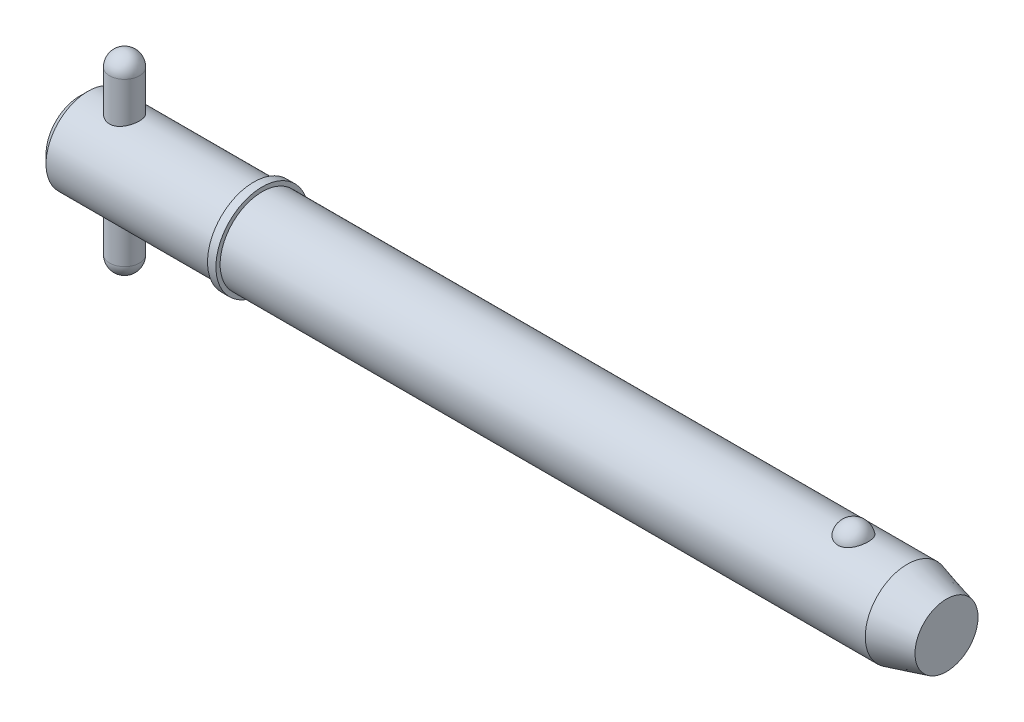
ISO-10303-21;
HEADER;
FILE_DESCRIPTION(('STEP AP214'),'2;1');
FILE_NAME('part.step','',(''),(''),'','','');
FILE_SCHEMA(('AUTOMOTIVE_DESIGN { 1 0 10303 214 1 1 1 1 }'));
ENDSEC;
DATA;
#1=APPLICATION_CONTEXT('core data for automotive mechanical design processes');
#2=APPLICATION_PROTOCOL_DEFINITION('international standard','automotive_design',2000,#1);
#3=PRODUCT_CONTEXT('',#1,'mechanical');
#4=PRODUCT('Part','Part','',(#3));
#5=PRODUCT_RELATED_PRODUCT_CATEGORY('part','',(#4));
#6=PRODUCT_DEFINITION_FORMATION('','',#4);
#7=PRODUCT_DEFINITION_CONTEXT('part definition',#1,'design');
#8=PRODUCT_DEFINITION('design','',#6,#7);
#9=PRODUCT_DEFINITION_SHAPE('','',#8);
#10=(LENGTH_UNIT() NAMED_UNIT(*) SI_UNIT(.MILLI.,.METRE.));
#11=(NAMED_UNIT(*) PLANE_ANGLE_UNIT() SI_UNIT($,.RADIAN.));
#12=(NAMED_UNIT(*) SI_UNIT($,.STERADIAN.) SOLID_ANGLE_UNIT());
#13=UNCERTAINTY_MEASURE_WITH_UNIT(LENGTH_MEASURE(1.E-05),#10,'distance_accuracy_value','');
#14=(GEOMETRIC_REPRESENTATION_CONTEXT(3) GLOBAL_UNCERTAINTY_ASSIGNED_CONTEXT((#13)) GLOBAL_UNIT_ASSIGNED_CONTEXT((#10,
#11,#12)) REPRESENTATION_CONTEXT('',''));
#15=CARTESIAN_POINT('',(0.,0.,0.));
#16=DIRECTION('',(0.,0.,1.));
#17=DIRECTION('',(1.,0.,0.));
#18=AXIS2_PLACEMENT_3D('',#15,#16,#17);
#19=CARTESIAN_POINT('',(5.94,12.7,0.));
#20=DIRECTION('',(0.,-1.,0.));
#21=DIRECTION('',(0.,0.,-1.));
#22=AXIS2_PLACEMENT_3D('',#19,#20,#21);
#23=CYLINDRICAL_SURFACE('',#22,1.98);
#24=CARTESIAN_POINT('',(5.94,-10.72,0.));
#25=DIRECTION('',(0.,-1.,0.));
#26=DIRECTION('',(0.,0.,-1.));
#27=AXIS2_PLACEMENT_3D('',#24,#25,#26);
#28=CIRCLE('',#27,1.98);
#29=CARTESIAN_POINT('',(5.94,-10.72,-1.98));
#30=VERTEX_POINT('',#29);
#31=EDGE_CURVE('P0_E10',#30,#30,#28,.F.);
#32=ORIENTED_EDGE('',*,*,#31,.T.);
#33=EDGE_LOOP('',(#32));
#34=FACE_BOUND('',#33,.T.);
#35=CARTESIAN_POINT('',(5.94,10.72,0.));
#36=DIRECTION('',(0.,-1.,0.));
#37=DIRECTION('',(0.,0.,-1.));
#38=AXIS2_PLACEMENT_3D('',#35,#36,#37);
#39=CIRCLE('',#38,1.98);
#40=CARTESIAN_POINT('',(5.94,10.72,-1.98));
#41=VERTEX_POINT('',#40);
#42=EDGE_CURVE('P0_E21',#41,#41,#39,.T.);
#43=ORIENTED_EDGE('',*,*,#42,.T.);
#44=EDGE_LOOP('',(#43));
#45=FACE_BOUND('',#44,.T.);
#46=ADVANCED_FACE('P0_F14',(#34,#45),#23,.T.);
#47=CARTESIAN_POINT('',(5.94,-10.72,0.));
#48=DIRECTION('',(0.,0.,1.));
#49=DIRECTION('',(1.,0.,0.));
#50=AXIS2_PLACEMENT_3D('',#47,#48,#49);
#51=SPHERICAL_SURFACE('',#50,1.98);
#52=CARTESIAN_POINT('',(5.94,-10.72,0.));
#53=DIRECTION('',(0.,-1.,0.));
#54=DIRECTION('',(0.,0.,-1.));
#55=AXIS2_PLACEMENT_3D('',#52,#53,#54);
#56=SPHERICAL_SURFACE('',#55,1.98);
#57=ORIENTED_EDGE('',*,*,#31,.F.);
#58=EDGE_LOOP('',(#57));
#59=FACE_BOUND('',#58,.T.);
#60=ADVANCED_FACE('P0_F29',(#59),#56,.T.);
#61=CARTESIAN_POINT('',(5.94,10.72,0.));
#62=DIRECTION('',(0.,0.,1.));
#63=DIRECTION('',(1.,0.,0.));
#64=AXIS2_PLACEMENT_3D('',#61,#62,#63);
#65=SPHERICAL_SURFACE('',#64,1.98);
#66=CARTESIAN_POINT('',(5.94,10.72,0.));
#67=DIRECTION('',(0.,-1.,0.));
#68=DIRECTION('',(0.,0.,-1.));
#69=AXIS2_PLACEMENT_3D('',#66,#67,#68);
#70=SPHERICAL_SURFACE('',#69,1.98);
#71=ORIENTED_EDGE('',*,*,#42,.F.);
#72=EDGE_LOOP('',(#71));
#73=FACE_BOUND('',#72,.T.);
#74=ADVANCED_FACE('P0_F16',(#73),#70,.T.);
#75=CLOSED_SHELL('',(#46,#60,#74));
#76=MANIFOLD_SOLID_BREP('P0_B1',#75);
#77=CARTESIAN_POINT('',(0.,0.,0.));
#78=DIRECTION('',(1.,0.,0.));
#79=DIRECTION('',(0.,0.,-1.));
#80=AXIS2_PLACEMENT_3D('',#77,#78,#79);
#81=CYLINDRICAL_SURFACE('',#80,5.555);
#82=CARTESIAN_POINT('',(109.417114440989,0.,0.));
#83=DIRECTION('',(1.,0.,0.));
#84=DIRECTION('',(0.,0.,-1.));
#85=AXIS2_PLACEMENT_3D('',#82,#83,#84);
#86=CIRCLE('',#85,5.555);
#87=CARTESIAN_POINT('',(109.417114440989,0.,-5.555));
#88=VERTEX_POINT('',#87);
#89=EDGE_CURVE('P1_E81',#88,#88,#86,.T.);
#90=ORIENTED_EDGE('',*,*,#89,.F.);
#91=EDGE_LOOP('',(#90));
#92=FACE_BOUND('',#91,.T.);
#93=CARTESIAN_POINT('',(24.13,0.,0.));
#94=DIRECTION('',(1.,0.,0.));
#95=DIRECTION('',(0.,0.,-1.));
#96=AXIS2_PLACEMENT_3D('',#93,#94,#95);
#97=CIRCLE('',#96,5.555);
#98=CARTESIAN_POINT('',(24.13,0.,-5.555));
#99=VERTEX_POINT('',#98);
#100=EDGE_CURVE('P1_E85',#99,#99,#97,.T.);
#101=ORIENTED_EDGE('',*,*,#100,.T.);
#102=EDGE_LOOP('',(#101));
#103=FACE_BOUND('',#102,.T.);
#104=CARTESIAN_POINT('',(102.298626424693,5.16741224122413,2.03859650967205));
#105=CARTESIAN_POINT('',(102.192949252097,5.16740893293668,2.03859990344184));
#106=CARTESIAN_POINT('',(102.08729894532,5.17079470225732,2.03008306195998));
#107=CARTESIAN_POINT('',(101.879141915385,5.18392795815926,1.9963072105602));
#108=CARTESIAN_POINT('',(101.776634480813,5.19367399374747,1.9710520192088));
#109=CARTESIAN_POINT('',(101.577771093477,5.21839168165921,1.90463997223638));
#110=CARTESIAN_POINT('',(101.481406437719,5.23335573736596,1.86350622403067));
#111=CARTESIAN_POINT('',(101.297080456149,5.26688076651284,1.76652592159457));
#112=CARTESIAN_POINT('',(101.209120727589,5.28544242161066,1.71067657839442));
#113=CARTESIAN_POINT('',(101.041265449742,5.32479845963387,1.58399959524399));
#114=CARTESIAN_POINT('',(100.96166564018,5.34564089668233,1.51279545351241));
#115=CARTESIAN_POINT('',(100.81512901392,5.38697258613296,1.35828584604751));
#116=CARTESIAN_POINT('',(100.748194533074,5.40746177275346,1.27497815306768));
#117=CARTESIAN_POINT('',(100.62561039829,5.44694508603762,1.09440293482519));
#118=CARTESIAN_POINT('',(100.570598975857,5.46583143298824,0.996677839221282));
#119=CARTESIAN_POINT('',(100.476937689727,5.49908030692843,0.792961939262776));
#120=CARTESIAN_POINT('',(100.438289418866,5.513442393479,0.686970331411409));
#121=CARTESIAN_POINT('',(100.377680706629,5.536358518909,0.468019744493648));
#122=CARTESIAN_POINT('',(100.355972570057,5.54482455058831,0.354981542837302));
#123=CARTESIAN_POINT('',(100.330636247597,5.55473324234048,0.126595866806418));
#124=CARTESIAN_POINT('',(100.327007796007,5.55617600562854,0.0112484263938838));
#125=CARTESIAN_POINT('',(100.337881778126,5.55189984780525,-0.218011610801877));
#126=CARTESIAN_POINT('',(100.352315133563,5.54620821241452,-0.331928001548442));
#127=CARTESIAN_POINT('',(100.398903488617,5.52828920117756,-0.555544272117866));
#128=CARTESIAN_POINT('',(100.431058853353,5.5160616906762,-0.665244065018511));
#129=CARTESIAN_POINT('',(100.512488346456,5.48630779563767,-0.877469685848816));
#130=CARTESIAN_POINT('',(100.561781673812,5.4687754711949,-0.979987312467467));
#131=CARTESIAN_POINT('',(100.676478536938,5.43024700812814,-1.17486975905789));
#132=CARTESIAN_POINT('',(100.741883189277,5.4092506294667,-1.26723387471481));
#133=CARTESIAN_POINT('',(100.887571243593,5.36600927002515,-1.43940133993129));
#134=CARTESIAN_POINT('',(100.967885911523,5.34376173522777,-1.5191776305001));
#135=CARTESIAN_POINT('',(101.141452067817,5.30057971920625,-1.66360338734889));
#136=CARTESIAN_POINT('',(101.234702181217,5.27964509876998,-1.72825445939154));
#137=CARTESIAN_POINT('',(101.429393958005,5.24205250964,-1.8390947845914));
#138=CARTESIAN_POINT('',(101.530590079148,5.22530519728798,-1.88568407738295));
#139=CARTESIAN_POINT('',(101.740155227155,5.19750919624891,-1.96100802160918));
#140=CARTESIAN_POINT('',(101.848521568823,5.18645838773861,-1.98974931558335));
#141=CARTESIAN_POINT('',(102.063498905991,5.17184410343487,-2.02742262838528));
#142=CARTESIAN_POINT('',(102.169925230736,5.16793282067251,-2.0372760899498));
#143=CARTESIAN_POINT('',(102.382992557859,5.1669899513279,-2.03966777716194));
#144=CARTESIAN_POINT('',(102.489633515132,5.16995704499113,-2.03220932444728));
#145=CARTESIAN_POINT('',(102.696773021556,5.18222383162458,-2.0007117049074));
#146=CARTESIAN_POINT('',(102.797359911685,5.19133213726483,-1.97717337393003));
#147=CARTESIAN_POINT('',(102.993014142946,5.21467637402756,-1.91475248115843));
#148=CARTESIAN_POINT('',(103.088081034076,5.22891272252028,-1.8758686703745));
#149=CARTESIAN_POINT('',(103.272371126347,5.26137066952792,-1.78282713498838));
#150=CARTESIAN_POINT('',(103.361419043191,5.27967329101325,-1.7283512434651));
#151=CARTESIAN_POINT('',(103.529288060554,5.31817411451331,-1.60597483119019));
#152=CARTESIAN_POINT('',(103.608106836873,5.33837274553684,-1.53807126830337));
#153=CARTESIAN_POINT('',(103.757515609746,5.37968287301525,-1.38688970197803));
#154=CARTESIAN_POINT('',(103.827505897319,5.40079011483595,-1.30301744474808));
#155=CARTESIAN_POINT('',(103.953012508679,5.44074401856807,-1.12458170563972));
#156=CARTESIAN_POINT('',(104.008526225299,5.4595902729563,-1.03001630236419));
#157=CARTESIAN_POINT('',(104.105550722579,5.49369849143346,-0.829439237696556));
#158=CARTESIAN_POINT('',(104.146548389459,5.50882422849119,-0.723155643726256));
#159=CARTESIAN_POINT('',(104.211125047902,5.53310911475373,-0.504772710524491));
#160=CARTESIAN_POINT('',(104.234703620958,5.54226812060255,-0.39267323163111));
#161=CARTESIAN_POINT('',(104.264013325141,5.55370358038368,-0.165459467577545));
#162=CARTESIAN_POINT('',(104.269688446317,5.55595843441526,-0.0503368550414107));
#163=CARTESIAN_POINT('',(104.262916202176,5.55329317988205,0.179288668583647));
#164=CARTESIAN_POINT('',(104.250469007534,5.54837313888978,0.293791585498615));
#165=CARTESIAN_POINT('',(104.207779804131,5.53189037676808,0.518526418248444));
#166=CARTESIAN_POINT('',(104.177598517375,5.5203503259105,0.628771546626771));
#167=CARTESIAN_POINT('',(104.100096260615,5.49182453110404,0.84231815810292));
#168=CARTESIAN_POINT('',(104.052774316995,5.47483847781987,0.945619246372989));
#169=CARTESIAN_POINT('',(103.941720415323,5.43710633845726,1.14281571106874));
#170=CARTESIAN_POINT('',(103.877921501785,5.41634501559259,1.23667048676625));
#171=CARTESIAN_POINT('',(103.735357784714,5.37334572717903,1.4118524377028));
#172=CARTESIAN_POINT('',(103.65659323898,5.35110778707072,1.49317982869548));
#173=CARTESIAN_POINT('',(103.486423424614,5.30779474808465,1.64049162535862));
#174=CARTESIAN_POINT('',(103.39510026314,5.28671324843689,1.70656877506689));
#175=CARTESIAN_POINT('',(103.201739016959,5.2480485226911,1.82201372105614));
#176=CARTESIAN_POINT('',(103.099700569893,5.23046541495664,1.87138095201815));
#177=CARTESIAN_POINT('',(102.883618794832,5.20042692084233,1.95335298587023));
#178=CARTESIAN_POINT('',(102.769260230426,5.18820192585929,1.98521734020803));
#179=CARTESIAN_POINT('',(102.536130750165,5.17169804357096,2.02783294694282));
#180=CARTESIAN_POINT('',(102.417361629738,5.16741595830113,2.03859269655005));
#181=CARTESIAN_POINT('',(102.298626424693,5.16741224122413,2.03859650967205));
#182=B_SPLINE_CURVE_WITH_KNOTS('',3,(#104,#105,#106,#107,#108,#109,#110,#111,#112,#113,#114,
#115,#116,#117,#118,#119,#120,#121,#122,#123,#124,#125,#126,#127,#128,#129,#130,#131,#132,#133,
#134,#135,#136,#137,#138,#139,#140,#141,#142,#143,#144,#145,#146,#147,#148,#149,#150,#151,#152,
#153,#154,#155,#156,#157,#158,#159,#160,#161,#162,#163,#164,#165,#166,#167,#168,#169,#170,#171,
#172,#173,#174,#175,#176,#177,#178,#179,#180,#181),.UNSPECIFIED.,.T.,.F.,(4,2,2,2,2,2,2,2,2,2,2,
2,2,2,2,2,2,2,2,2,2,2,2,2,2,2,2,2,2,2,2,2,2,2,2,2,2,2,4),(0.,0.316595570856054,
0.633118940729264,0.949183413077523,1.26530783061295,1.59030762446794,1.91536729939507,
2.25495824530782,2.59458224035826,2.93917283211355,3.28375835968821,3.62703002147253,
3.97030875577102,4.3139732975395,4.65766166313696,5.00207904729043,5.3464598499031,
5.68270547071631,6.0188258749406,6.33808403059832,6.65728093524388,6.96696376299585,
7.27667180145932,7.59321535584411,7.90983070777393,8.24210387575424,8.57443684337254,
8.91755896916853,9.26068933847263,9.60489211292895,9.949091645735,10.2921194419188,
10.6351667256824,10.9796305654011,11.324088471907,11.666392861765,12.0087088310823,
12.3645679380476,12.7202837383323),.UNSPECIFIED.);
#183=CARTESIAN_POINT('',(102.298626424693,5.16741224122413,2.03859650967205));
#184=VERTEX_POINT('',#183);
#185=EDGE_CURVE('P1_E35',#184,#184,#182,.T.);
#186=ORIENTED_EDGE('',*,*,#185,.T.);
#187=EDGE_LOOP('',(#186));
#188=FACE_BOUND('',#187,.T.);
#189=ADVANCED_FACE('P1_F13',(#92,#103,#188),#81,.T.);
#190=CARTESIAN_POINT('',(0.,0.,0.));
#191=DIRECTION('',(-1.,0.,0.));
#192=DIRECTION('',(0.,0.,1.));
#193=AXIS2_PLACEMENT_3D('',#190,#191,#192);
#194=PLANE('',#193);
#195=CARTESIAN_POINT('',(0.,0.,0.));
#196=DIRECTION('',(1.,0.,0.));
#197=DIRECTION('',(0.,0.,-1.));
#198=AXIS2_PLACEMENT_3D('',#195,#196,#197);
#199=CIRCLE('',#198,4.444);
#200=CARTESIAN_POINT('',(0.,0.,-4.444));
#201=VERTEX_POINT('',#200);
#202=EDGE_CURVE('P1_E9',#201,#201,#199,.T.);
#203=ORIENTED_EDGE('',*,*,#202,.F.);
#204=EDGE_LOOP('',(#203));
#205=FACE_BOUND('',#204,.T.);
#206=ADVANCED_FACE('P1_F15',(#205),#194,.T.);
#207=CARTESIAN_POINT('',(1.111,0.,0.));
#208=DIRECTION('',(1.,0.,0.));
#209=DIRECTION('',(0.,0.,-1.));
#210=AXIS2_PLACEMENT_3D('',#207,#208,#209);
#211=CONICAL_SURFACE('',#210,5.555,0.78539816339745);
#212=ORIENTED_EDGE('',*,*,#202,.T.);
#213=EDGE_LOOP('',(#212));
#214=FACE_BOUND('',#213,.T.);
#215=CARTESIAN_POINT('',(1.111,0.,0.));
#216=DIRECTION('',(1.,0.,0.));
#217=DIRECTION('',(0.,0.,-1.));
#218=AXIS2_PLACEMENT_3D('',#215,#216,#217);
#219=CIRCLE('',#218,5.555);
#220=CARTESIAN_POINT('',(1.111,0.,-5.555));
#221=VERTEX_POINT('',#220);
#222=EDGE_CURVE('P1_E26',#221,#221,#219,.T.);
#223=ORIENTED_EDGE('',*,*,#222,.F.);
#224=EDGE_LOOP('',(#223));
#225=FACE_BOUND('',#224,.T.);
#226=ADVANCED_FACE('P1_F77',(#214,#225),#211,.T.);
#227=CARTESIAN_POINT('',(0.,0.,0.));
#228=DIRECTION('',(1.,0.,0.));
#229=DIRECTION('',(0.,0.,-1.));
#230=AXIS2_PLACEMENT_3D('',#227,#228,#229);
#231=CYLINDRICAL_SURFACE('',#230,5.555);
#232=CARTESIAN_POINT('',(5.94,-5.19014691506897,1.98));
#233=CARTESIAN_POINT('',(5.83264687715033,-5.19014494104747,1.98000226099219));
#234=CARTESIAN_POINT('',(5.7253094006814,-5.19351395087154,1.97123988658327));
#235=CARTESIAN_POINT('',(5.51384517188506,-5.20654291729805,1.93656219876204));
#236=CARTESIAN_POINT('',(5.40971858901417,-5.21620320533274,1.91064598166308));
#237=CARTESIAN_POINT('',(5.20778082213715,-5.24058443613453,1.84271148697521));
#238=CARTESIAN_POINT('',(5.10995634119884,-5.25529427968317,1.80072850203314));
#239=CARTESIAN_POINT('',(4.92270352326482,-5.28810012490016,1.70197537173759));
#240=CARTESIAN_POINT('',(4.83327743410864,-5.3061970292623,1.64520128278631));
#241=CARTESIAN_POINT('',(4.66135184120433,-5.34464714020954,1.51575187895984));
#242=CARTESIAN_POINT('',(4.57928277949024,-5.36506222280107,1.44252311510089));
#243=CARTESIAN_POINT('',(4.42829115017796,-5.40532920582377,1.28342047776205));
#244=CARTESIAN_POINT('',(4.35937105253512,-5.42518099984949,1.19754423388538));
#245=CARTESIAN_POINT('',(4.23461605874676,-5.46281133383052,1.01237205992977));
#246=CARTESIAN_POINT('',(4.17924129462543,-5.48050875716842,0.912748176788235));
#247=CARTESIAN_POINT('',(4.0862117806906,-5.51109938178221,0.70485824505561));
#248=CARTESIAN_POINT('',(4.0485515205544,-5.52399407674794,0.596594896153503));
#249=CARTESIAN_POINT('',(3.99350662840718,-5.54308759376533,0.379019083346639));
#250=CARTESIAN_POINT('',(3.97538263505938,-5.54952987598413,0.269915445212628));
#251=CARTESIAN_POINT('',(3.95756405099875,-5.55586205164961,0.0500378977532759));
#252=CARTESIAN_POINT('',(3.95786404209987,-5.55575387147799,-0.060735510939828));
#253=CARTESIAN_POINT('',(3.97643665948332,-5.54915684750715,-0.275539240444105));
#254=CARTESIAN_POINT('',(3.99390415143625,-5.54295384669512,-0.379649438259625));
#255=CARTESIAN_POINT('',(4.0449721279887,-5.52523170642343,-0.583350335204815));
#256=CARTESIAN_POINT('',(4.07857373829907,-5.51371219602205,-0.682940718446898));
#257=CARTESIAN_POINT('',(4.16137312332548,-5.4863099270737,-0.876423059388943));
#258=CARTESIAN_POINT('',(4.2107826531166,-5.47036834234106,-0.970215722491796));
#259=CARTESIAN_POINT('',(4.32361427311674,-5.43575653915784,-1.1484017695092));
#260=CARTESIAN_POINT('',(4.38704062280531,-5.41708549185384,-1.23279228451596));
#261=CARTESIAN_POINT('',(4.53006791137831,-5.37778429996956,-1.39454579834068));
#262=CARTESIAN_POINT('',(4.61035105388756,-5.35710277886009,-1.4712940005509));
#263=CARTESIAN_POINT('',(4.78279835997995,-5.31692766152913,-1.6104545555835));
#264=CARTESIAN_POINT('',(4.874964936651,-5.29743430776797,-1.67286398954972));
#265=CARTESIAN_POINT('',(5.07076688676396,-5.26153775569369,-1.78259698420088));
#266=CARTESIAN_POINT('',(5.17458163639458,-5.24519780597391,-1.8296227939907));
#267=CARTESIAN_POINT('',(5.38938990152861,-5.21818744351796,-1.90530278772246));
#268=CARTESIAN_POINT('',(5.50037985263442,-5.20751423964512,-1.93396601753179));
#269=CARTESIAN_POINT('',(5.72036376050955,-5.19369176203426,-1.97077654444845));
#270=CARTESIAN_POINT('',(5.82917370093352,-5.19018851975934,-1.97989015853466));
#271=CARTESIAN_POINT('',(6.04680100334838,-5.19010609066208,-1.98010779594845));
#272=CARTESIAN_POINT('',(6.15561835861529,-5.19352540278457,-1.97121572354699));
#273=CARTESIAN_POINT('',(6.36548036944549,-5.20654623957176,-1.93654727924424));
#274=CARTESIAN_POINT('',(6.46666051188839,-5.21588705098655,-1.91148218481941));
#275=CARTESIAN_POINT('',(6.66334537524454,-5.23939939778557,-1.84605494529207));
#276=CARTESIAN_POINT('',(6.75884899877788,-5.25357186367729,-1.8056898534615));
#277=CARTESIAN_POINT('',(6.94517989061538,-5.28576258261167,-1.70921153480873));
#278=CARTESIAN_POINT('',(7.03572661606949,-5.30389804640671,-1.65259670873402));
#279=CARTESIAN_POINT('',(7.20638087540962,-5.34176077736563,-1.52577523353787));
#280=CARTESIAN_POINT('',(7.28648490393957,-5.36148857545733,-1.45556404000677));
#281=CARTESIAN_POINT('',(7.43864697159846,-5.40165494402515,-1.2988614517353));
#282=CARTESIAN_POINT('',(7.50999887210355,-5.42207106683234,-1.21167640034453));
#283=CARTESIAN_POINT('',(7.63712639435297,-5.46023601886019,-1.026066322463));
#284=CARTESIAN_POINT('',(7.69290228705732,-5.47798489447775,-0.927641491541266));
#285=CARTESIAN_POINT('',(7.78684673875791,-5.50876590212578,-0.722633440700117));
#286=CARTESIAN_POINT('',(7.82510508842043,-5.52182201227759,-0.616095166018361));
#287=CARTESIAN_POINT('',(7.88297051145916,-5.54184206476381,-0.397530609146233));
#288=CARTESIAN_POINT('',(7.90258540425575,-5.5488085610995,-0.285506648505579));
#289=CARTESIAN_POINT('',(7.9218262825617,-5.55564472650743,-0.065566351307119));
#290=CARTESIAN_POINT('',(7.92245987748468,-5.55587212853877,0.0422515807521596));
#291=CARTESIAN_POINT('',(7.90626329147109,-5.55011340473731,0.256387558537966));
#292=CARTESIAN_POINT('',(7.88943488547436,-5.54412791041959,0.362705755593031));
#293=CARTESIAN_POINT('',(7.83948457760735,-5.52676548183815,0.568649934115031));
#294=CARTESIAN_POINT('',(7.8067003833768,-5.51550046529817,0.668367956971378));
#295=CARTESIAN_POINT('',(7.72609369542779,-5.48874437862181,0.860911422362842));
#296=CARTESIAN_POINT('',(7.67826838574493,-5.47325251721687,0.953735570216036));
#297=CARTESIAN_POINT('',(7.56675024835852,-5.43884382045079,1.13391068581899));
#298=CARTESIAN_POINT('',(7.50249968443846,-5.41981485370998,1.22089468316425));
#299=CARTESIAN_POINT('',(7.36086495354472,-5.38069275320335,1.38316665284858));
#300=CARTESIAN_POINT('',(7.28347630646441,-5.36059925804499,1.45845061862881));
#301=CARTESIAN_POINT('',(7.11347587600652,-5.32048380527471,1.59876646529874));
#302=CARTESIAN_POINT('',(7.02032386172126,-5.30050854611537,1.66315951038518));
#303=CARTESIAN_POINT('',(6.82388804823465,-5.26398994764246,1.77536801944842));
#304=CARTESIAN_POINT('',(6.7206049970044,-5.24744635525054,1.82318470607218));
#305=CARTESIAN_POINT('',(6.50639706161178,-5.21987969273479,1.90068230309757));
#306=CARTESIAN_POINT('',(6.3954529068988,-5.20887116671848,1.93031547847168));
#307=CARTESIAN_POINT('',(6.16966522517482,-5.19400760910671,1.96996824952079));
#308=CARTESIAN_POINT('',(6.05482366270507,-5.19014902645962,1.97999758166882));
#309=CARTESIAN_POINT('',(5.94,-5.19014691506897,1.98));
#310=B_SPLINE_CURVE_WITH_KNOTS('',3,(#232,#233,#234,#235,#236,#237,#238,#239,#240,#241,#242,
#243,#244,#245,#246,#247,#248,#249,#250,#251,#252,#253,#254,#255,#256,#257,#258,#259,#260,#261,
#262,#263,#264,#265,#266,#267,#268,#269,#270,#271,#272,#273,#274,#275,#276,#277,#278,#279,#280,
#281,#282,#283,#284,#285,#286,#287,#288,#289,#290,#291,#292,#293,#294,#295,#296,#297,#298,#299,
#300,#301,#302,#303,#304,#305,#306,#307,#308,#309),.UNSPECIFIED.,.T.,.F.,(4,2,2,2,2,2,2,2,2,2,2,
2,2,2,2,2,2,2,2,2,2,2,2,2,2,2,2,2,2,2,2,2,2,2,2,2,2,2,4),(0.,0.321632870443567,
0.643282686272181,0.964229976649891,1.28526292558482,1.61937087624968,1.9535415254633,
2.29784481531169,2.64204093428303,2.97269632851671,3.30325448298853,3.61901541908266,
3.93479838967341,4.25500220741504,4.57530346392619,4.91268648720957,5.25013812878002,
5.59378026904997,5.93725299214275,6.26331481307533,6.58930593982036,6.90185604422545,
7.21446637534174,7.53801472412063,7.86167140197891,8.20353561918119,8.54539388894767,
8.88547970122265,9.22542281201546,9.54728637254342,9.86911722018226,10.1844146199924,
10.4997710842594,10.827730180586,11.1558013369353,11.499115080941,11.8424034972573,
12.1865892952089,12.5306041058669),.UNSPECIFIED.);
#311=CARTESIAN_POINT('',(5.94,-5.19014691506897,1.98));
#312=VERTEX_POINT('',#311);
#313=EDGE_CURVE('P1_E17',#312,#312,#310,.T.);
#314=ORIENTED_EDGE('',*,*,#313,.F.);
#315=EDGE_LOOP('',(#314));
#316=FACE_BOUND('',#315,.T.);
#317=CARTESIAN_POINT('',(5.94,5.19014691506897,1.98));
#318=CARTESIAN_POINT('',(6.04735312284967,5.19014494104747,1.98000226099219));
#319=CARTESIAN_POINT('',(6.1546905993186,5.19351395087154,1.97123988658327));
#320=CARTESIAN_POINT('',(6.36615482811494,5.20654291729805,1.93656219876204));
#321=CARTESIAN_POINT('',(6.47028141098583,5.21620320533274,1.91064598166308));
#322=CARTESIAN_POINT('',(6.67221917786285,5.24058443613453,1.84271148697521));
#323=CARTESIAN_POINT('',(6.77004365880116,5.25529427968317,1.80072850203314));
#324=CARTESIAN_POINT('',(6.95729647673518,5.28810012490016,1.70197537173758));
#325=CARTESIAN_POINT('',(7.04672256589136,5.3061970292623,1.64520128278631));
#326=CARTESIAN_POINT('',(7.21864815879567,5.34464714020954,1.51575187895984));
#327=CARTESIAN_POINT('',(7.30071722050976,5.36506222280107,1.44252311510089));
#328=CARTESIAN_POINT('',(7.45170884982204,5.40532920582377,1.28342047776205));
#329=CARTESIAN_POINT('',(7.52062894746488,5.42518099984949,1.19754423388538));
#330=CARTESIAN_POINT('',(7.64538394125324,5.46281133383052,1.01237205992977));
#331=CARTESIAN_POINT('',(7.70075870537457,5.48050875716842,0.912748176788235));
#332=CARTESIAN_POINT('',(7.7937882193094,5.51109938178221,0.704858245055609));
#333=CARTESIAN_POINT('',(7.8314484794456,5.52399407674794,0.596594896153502));
#334=CARTESIAN_POINT('',(7.88649337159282,5.54308759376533,0.379019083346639));
#335=CARTESIAN_POINT('',(7.90461736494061,5.54952987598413,0.269915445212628));
#336=CARTESIAN_POINT('',(7.92243594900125,5.55586205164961,0.0500378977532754));
#337=CARTESIAN_POINT('',(7.92213595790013,5.55575387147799,-0.0607355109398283));
#338=CARTESIAN_POINT('',(7.90356334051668,5.54915684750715,-0.275539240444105));
#339=CARTESIAN_POINT('',(7.88609584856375,5.54295384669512,-0.379649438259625));
#340=CARTESIAN_POINT('',(7.8350278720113,5.52523170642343,-0.583350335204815));
#341=CARTESIAN_POINT('',(7.80142626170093,5.51371219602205,-0.682940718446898));
#342=CARTESIAN_POINT('',(7.71862687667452,5.4863099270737,-0.876423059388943));
#343=CARTESIAN_POINT('',(7.6692173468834,5.47036834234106,-0.970215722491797));
#344=CARTESIAN_POINT('',(7.55638572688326,5.43575653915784,-1.1484017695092));
#345=CARTESIAN_POINT('',(7.49295937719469,5.41708549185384,-1.23279228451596));
#346=CARTESIAN_POINT('',(7.34993208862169,5.37778429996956,-1.39454579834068));
#347=CARTESIAN_POINT('',(7.26964894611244,5.35710277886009,-1.4712940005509));
#348=CARTESIAN_POINT('',(7.09720164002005,5.31692766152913,-1.6104545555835));
#349=CARTESIAN_POINT('',(7.00503506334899,5.29743430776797,-1.67286398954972));
#350=CARTESIAN_POINT('',(6.80923311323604,5.26153775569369,-1.78259698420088));
#351=CARTESIAN_POINT('',(6.70541836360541,5.24519780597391,-1.8296227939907));
#352=CARTESIAN_POINT('',(6.49061009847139,5.21818744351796,-1.90530278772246));
#353=CARTESIAN_POINT('',(6.37962014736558,5.20751423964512,-1.93396601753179));
#354=CARTESIAN_POINT('',(6.15963623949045,5.19369176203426,-1.97077654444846));
#355=CARTESIAN_POINT('',(6.05082629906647,5.19018851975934,-1.97989015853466));
#356=CARTESIAN_POINT('',(5.83319899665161,5.19010609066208,-1.98010779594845));
#357=CARTESIAN_POINT('',(5.7243816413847,5.19352540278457,-1.97121572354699));
#358=CARTESIAN_POINT('',(5.5145196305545,5.20654623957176,-1.93654727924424));
#359=CARTESIAN_POINT('',(5.4133394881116,5.21588705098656,-1.91148218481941));
#360=CARTESIAN_POINT('',(5.21665462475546,5.23939939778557,-1.84605494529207));
#361=CARTESIAN_POINT('',(5.12115100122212,5.25357186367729,-1.8056898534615));
#362=CARTESIAN_POINT('',(4.93482010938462,5.28576258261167,-1.70921153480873));
#363=CARTESIAN_POINT('',(4.84427338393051,5.30389804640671,-1.65259670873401));
#364=CARTESIAN_POINT('',(4.67361912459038,5.34176077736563,-1.52577523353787));
#365=CARTESIAN_POINT('',(4.59351509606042,5.36148857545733,-1.45556404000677));
#366=CARTESIAN_POINT('',(4.44135302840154,5.40165494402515,-1.2988614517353));
#367=CARTESIAN_POINT('',(4.37000112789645,5.42207106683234,-1.21167640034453));
#368=CARTESIAN_POINT('',(4.24287360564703,5.46023601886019,-1.026066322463));
#369=CARTESIAN_POINT('',(4.18709771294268,5.47798489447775,-0.927641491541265));
#370=CARTESIAN_POINT('',(4.09315326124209,5.50876590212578,-0.722633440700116));
#371=CARTESIAN_POINT('',(4.05489491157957,5.52182201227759,-0.61609516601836));
#372=CARTESIAN_POINT('',(3.99702948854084,5.54184206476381,-0.397530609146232));
#373=CARTESIAN_POINT('',(3.97741459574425,5.5488085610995,-0.285506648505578));
#374=CARTESIAN_POINT('',(3.9581737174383,5.55564472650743,-0.0655663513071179));
#375=CARTESIAN_POINT('',(3.95754012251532,5.55587212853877,0.0422515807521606));
#376=CARTESIAN_POINT('',(3.97373670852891,5.55011340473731,0.256387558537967));
#377=CARTESIAN_POINT('',(3.99056511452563,5.54412791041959,0.362705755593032));
#378=CARTESIAN_POINT('',(4.04051542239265,5.52676548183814,0.568649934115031));
#379=CARTESIAN_POINT('',(4.07329961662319,5.51550046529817,0.668367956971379));
#380=CARTESIAN_POINT('',(4.15390630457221,5.48874437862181,0.860911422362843));
#381=CARTESIAN_POINT('',(4.20173161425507,5.47325251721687,0.953735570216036));
#382=CARTESIAN_POINT('',(4.31324975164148,5.43884382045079,1.13391068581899));
#383=CARTESIAN_POINT('',(4.37750031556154,5.41981485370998,1.22089468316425));
#384=CARTESIAN_POINT('',(4.51913504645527,5.38069275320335,1.38316665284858));
#385=CARTESIAN_POINT('',(4.59652369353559,5.36059925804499,1.45845061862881));
#386=CARTESIAN_POINT('',(4.76652412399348,5.32048380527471,1.59876646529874));
#387=CARTESIAN_POINT('',(4.85967613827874,5.30050854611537,1.66315951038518));
#388=CARTESIAN_POINT('',(5.05611195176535,5.26398994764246,1.77536801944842));
#389=CARTESIAN_POINT('',(5.1593950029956,5.24744635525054,1.82318470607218));
#390=CARTESIAN_POINT('',(5.37360293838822,5.21987969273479,1.90068230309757));
#391=CARTESIAN_POINT('',(5.4845470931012,5.20887116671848,1.93031547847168));
#392=CARTESIAN_POINT('',(5.71033477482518,5.19400760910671,1.96996824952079));
#393=CARTESIAN_POINT('',(5.82517633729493,5.19014902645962,1.97999758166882));
#394=CARTESIAN_POINT('',(5.94,5.19014691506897,1.98));
#395=B_SPLINE_CURVE_WITH_KNOTS('',3,(#317,#318,#319,#320,#321,#322,#323,#324,#325,#326,#327,
#328,#329,#330,#331,#332,#333,#334,#335,#336,#337,#338,#339,#340,#341,#342,#343,#344,#345,#346,
#347,#348,#349,#350,#351,#352,#353,#354,#355,#356,#357,#358,#359,#360,#361,#362,#363,#364,#365,
#366,#367,#368,#369,#370,#371,#372,#373,#374,#375,#376,#377,#378,#379,#380,#381,#382,#383,#384,
#385,#386,#387,#388,#389,#390,#391,#392,#393,#394),.UNSPECIFIED.,.T.,.F.,(4,2,2,2,2,2,2,2,2,2,2,
2,2,2,2,2,2,2,2,2,2,2,2,2,2,2,2,2,2,2,2,2,2,2,2,2,2,2,4),(0.,0.321632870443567,
0.643282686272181,0.964229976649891,1.28526292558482,1.61937087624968,1.9535415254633,
2.29784481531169,2.64204093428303,2.97269632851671,3.30325448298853,3.61901541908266,
3.93479838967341,4.25500220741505,4.57530346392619,4.91268648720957,5.25013812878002,
5.59378026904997,5.93725299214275,6.26331481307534,6.58930593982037,6.90185604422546,
7.21446637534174,7.53801472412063,7.86167140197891,8.20353561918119,8.54539388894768,
8.88547970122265,9.22542281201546,9.54728637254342,9.86911722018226,10.1844146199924,
10.4997710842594,10.827730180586,11.1558013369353,11.499115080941,11.8424034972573,
12.1865892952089,12.5306041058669),.UNSPECIFIED.);
#396=CARTESIAN_POINT('',(5.94,5.19014691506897,1.98));
#397=VERTEX_POINT('',#396);
#398=EDGE_CURVE('P1_E43',#397,#397,#395,.T.);
#399=ORIENTED_EDGE('',*,*,#398,.F.);
#400=EDGE_LOOP('',(#399));
#401=FACE_BOUND('',#400,.T.);
#402=ORIENTED_EDGE('',*,*,#222,.T.);
#403=EDGE_LOOP('',(#402));
#404=FACE_BOUND('',#403,.T.);
#405=CARTESIAN_POINT('',(23.019,0.,0.));
#406=DIRECTION('',(1.,0.,0.));
#407=DIRECTION('',(0.,0.,-1.));
#408=AXIS2_PLACEMENT_3D('',#405,#406,#407);
#409=CIRCLE('',#408,5.555);
#410=CARTESIAN_POINT('',(23.019,0.,-5.555));
#411=VERTEX_POINT('',#410);
#412=EDGE_CURVE('P1_E31',#411,#411,#409,.T.);
#413=ORIENTED_EDGE('',*,*,#412,.F.);
#414=EDGE_LOOP('',(#413));
#415=FACE_BOUND('',#414,.T.);
#416=ADVANCED_FACE('P1_F103',(#316,#401,#404,#415),#231,.T.);
#417=CARTESIAN_POINT('',(23.019,5.555,0.));
#418=DIRECTION('',(-1.,0.,0.));
#419=DIRECTION('',(0.,0.,1.));
#420=AXIS2_PLACEMENT_3D('',#417,#418,#419);
#421=PLANE('',#420);
#422=ORIENTED_EDGE('',*,*,#412,.T.);
#423=EDGE_LOOP('',(#422));
#424=FACE_BOUND('',#423,.T.);
#425=CARTESIAN_POINT('',(23.019,0.,0.));
#426=DIRECTION('',(1.,0.,0.));
#427=DIRECTION('',(0.,0.,-1.));
#428=AXIS2_PLACEMENT_3D('',#425,#426,#427);
#429=CIRCLE('',#428,6.1105);
#430=CARTESIAN_POINT('',(23.019,0.,-6.1105));
#431=VERTEX_POINT('',#430);
#432=EDGE_CURVE('P1_E91',#431,#431,#429,.T.);
#433=ORIENTED_EDGE('',*,*,#432,.F.);
#434=EDGE_LOOP('',(#433));
#435=FACE_BOUND('',#434,.T.);
#436=ADVANCED_FACE('P1_F100',(#424,#435),#421,.T.);
#437=CARTESIAN_POINT('',(0.,0.,0.));
#438=DIRECTION('',(1.,0.,0.));
#439=DIRECTION('',(0.,0.,-1.));
#440=AXIS2_PLACEMENT_3D('',#437,#438,#439);
#441=CYLINDRICAL_SURFACE('',#440,6.1105);
#442=ORIENTED_EDGE('',*,*,#432,.T.);
#443=EDGE_LOOP('',(#442));
#444=FACE_BOUND('',#443,.T.);
#445=CARTESIAN_POINT('',(24.13,0.,0.));
#446=DIRECTION('',(1.,0.,0.));
#447=DIRECTION('',(0.,0.,-1.));
#448=AXIS2_PLACEMENT_3D('',#445,#446,#447);
#449=CIRCLE('',#448,6.1105);
#450=CARTESIAN_POINT('',(24.13,0.,-6.1105));
#451=VERTEX_POINT('',#450);
#452=EDGE_CURVE('P1_E88',#451,#451,#449,.T.);
#453=ORIENTED_EDGE('',*,*,#452,.F.);
#454=EDGE_LOOP('',(#453));
#455=FACE_BOUND('',#454,.T.);
#456=ADVANCED_FACE('P1_F68',(#444,#455),#441,.T.);
#457=CARTESIAN_POINT('',(24.13,6.1105,0.));
#458=DIRECTION('',(1.,0.,0.));
#459=DIRECTION('',(0.,0.,-1.));
#460=AXIS2_PLACEMENT_3D('',#457,#458,#459);
#461=PLANE('',#460);
#462=ORIENTED_EDGE('',*,*,#452,.T.);
#463=EDGE_LOOP('',(#462));
#464=FACE_BOUND('',#463,.T.);
#465=ORIENTED_EDGE('',*,*,#100,.F.);
#466=EDGE_LOOP('',(#465));
#467=FACE_BOUND('',#466,.T.);
#468=ADVANCED_FACE('P1_F62',(#464,#467),#461,.T.);
#469=CARTESIAN_POINT('',(114.6,0.,0.));
#470=DIRECTION('',(-1.,0.,0.));
#471=DIRECTION('',(0.,0.,1.));
#472=AXIS2_PLACEMENT_3D('',#469,#470,#471);
#473=CONICAL_SURFACE('',#472,4.16625000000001,0.26179938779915);
#474=ORIENTED_EDGE('',*,*,#89,.T.);
#475=EDGE_LOOP('',(#474));
#476=FACE_BOUND('',#475,.T.);
#477=CARTESIAN_POINT('',(114.6,0.,0.));
#478=DIRECTION('',(1.,0.,0.));
#479=DIRECTION('',(0.,0.,-1.));
#480=AXIS2_PLACEMENT_3D('',#477,#478,#479);
#481=CIRCLE('',#480,4.16625000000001);
#482=CARTESIAN_POINT('',(114.6,0.,-4.16625000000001));
#483=VERTEX_POINT('',#482);
#484=EDGE_CURVE('P1_E42',#483,#483,#481,.T.);
#485=ORIENTED_EDGE('',*,*,#484,.F.);
#486=EDGE_LOOP('',(#485));
#487=FACE_BOUND('',#486,.T.);
#488=ADVANCED_FACE('P1_F59',(#476,#487),#473,.T.);
#489=CARTESIAN_POINT('',(114.6,4.16625000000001,0.));
#490=DIRECTION('',(1.,0.,0.));
#491=DIRECTION('',(0.,0.,-1.));
#492=AXIS2_PLACEMENT_3D('',#489,#490,#491);
#493=PLANE('',#492);
#494=ORIENTED_EDGE('',*,*,#484,.T.);
#495=EDGE_LOOP('',(#494));
#496=FACE_BOUND('',#495,.T.);
#497=ADVANCED_FACE('P1_F55',(#496),#493,.T.);
#498=CARTESIAN_POINT('',(102.298626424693,4.9995,0.));
#499=DIRECTION('',(-1.,0.,0.));
#500=DIRECTION('',(0.,1.,0.));
#501=AXIS2_PLACEMENT_3D('',#498,#499,#500);
#502=SPHERICAL_SURFACE('',#501,2.04549999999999);
#503=ORIENTED_EDGE('',*,*,#185,.F.);
#504=EDGE_LOOP('',(#503));
#505=FACE_BOUND('',#504,.T.);
#506=ADVANCED_FACE('P1_F50',(#505),#502,.T.);
#507=CARTESIAN_POINT('',(5.94,-6.1105,0.));
#508=DIRECTION('',(0.,1.,0.));
#509=DIRECTION('',(0.,0.,1.));
#510=AXIS2_PLACEMENT_3D('',#507,#508,#509);
#511=CYLINDRICAL_SURFACE('',#510,1.98);
#512=ORIENTED_EDGE('',*,*,#313,.T.);
#513=EDGE_LOOP('',(#512));
#514=FACE_BOUND('',#513,.T.);
#515=ORIENTED_EDGE('',*,*,#398,.T.);
#516=EDGE_LOOP('',(#515));
#517=FACE_BOUND('',#516,.T.);
#518=ADVANCED_FACE('P1_F54',(#514,#517),#511,.F.);
#519=CLOSED_SHELL('',(#189,#206,#226,#416,#436,#456,#468,#488,#497,#506,#518));
#520=MANIFOLD_SOLID_BREP('P1_B1',#519);
#521=ADVANCED_BREP_SHAPE_REPRESENTATION('',(#18,#76,#520),#14);
#522=SHAPE_DEFINITION_REPRESENTATION(#9,#521);
ENDSEC;
END-ISO-10303-21;
